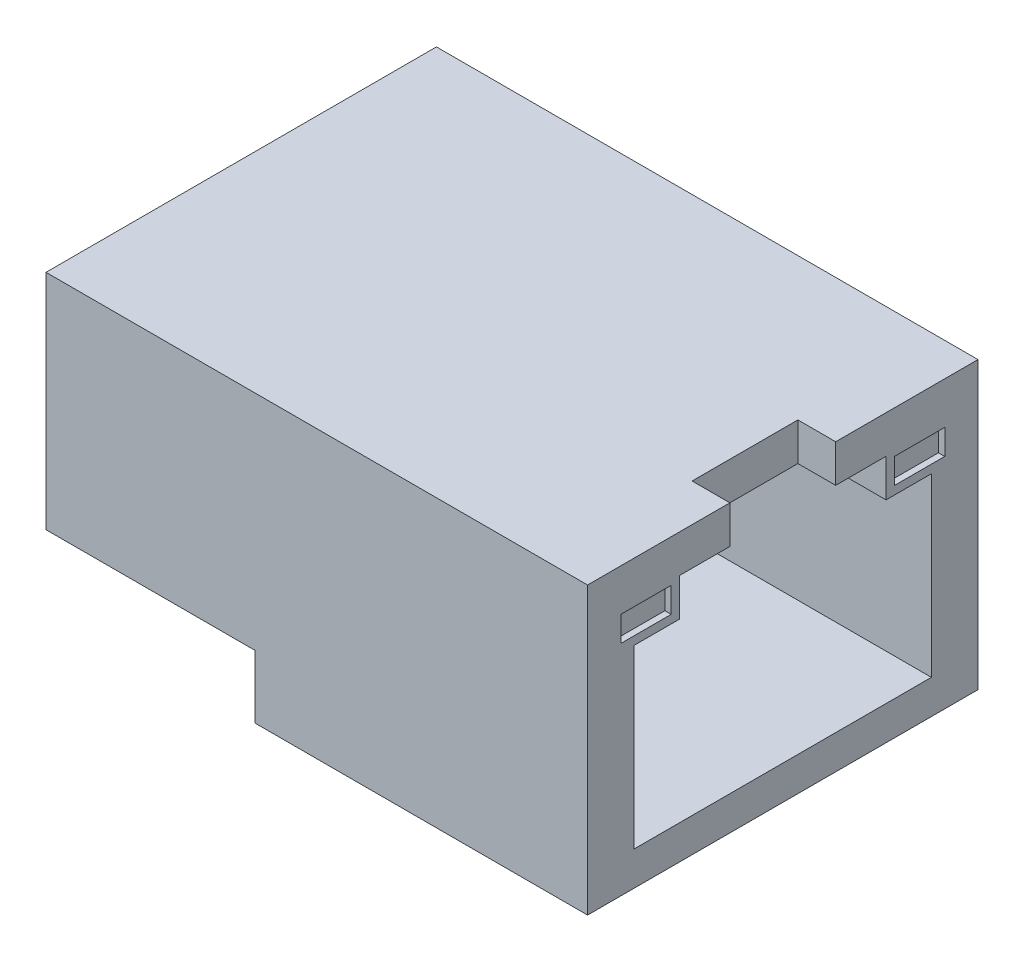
ISO-10303-21;
HEADER;
FILE_DESCRIPTION(('STEP AP214'),'2;1');
FILE_NAME('part.step','',(''),(''),'','','');
FILE_SCHEMA(('AUTOMOTIVE_DESIGN { 1 0 10303 214 1 1 1 1 }'));
ENDSEC;
DATA;
#1=APPLICATION_CONTEXT('core data for automotive mechanical design processes');
#2=APPLICATION_PROTOCOL_DEFINITION('international standard','automotive_design',2000,#1);
#3=PRODUCT_CONTEXT('',#1,'mechanical');
#4=PRODUCT('Part','Part','',(#3));
#5=PRODUCT_RELATED_PRODUCT_CATEGORY('part','',(#4));
#6=PRODUCT_DEFINITION_FORMATION('','',#4);
#7=PRODUCT_DEFINITION_CONTEXT('part definition',#1,'design');
#8=PRODUCT_DEFINITION('design','',#6,#7);
#9=PRODUCT_DEFINITION_SHAPE('','',#8);
#10=(LENGTH_UNIT() NAMED_UNIT(*) SI_UNIT(.MILLI.,.METRE.));
#11=(NAMED_UNIT(*) PLANE_ANGLE_UNIT() SI_UNIT($,.RADIAN.));
#12=(NAMED_UNIT(*) SI_UNIT($,.STERADIAN.) SOLID_ANGLE_UNIT());
#13=UNCERTAINTY_MEASURE_WITH_UNIT(LENGTH_MEASURE(1.E-05),#10,'distance_accuracy_value','');
#14=(GEOMETRIC_REPRESENTATION_CONTEXT(3) GLOBAL_UNCERTAINTY_ASSIGNED_CONTEXT((#13)) GLOBAL_UNIT_ASSIGNED_CONTEXT((#10,
#11,#12)) REPRESENTATION_CONTEXT('',''));
#15=CARTESIAN_POINT('',(0.,0.,0.));
#16=DIRECTION('',(0.,0.,1.));
#17=DIRECTION('',(1.,0.,0.));
#18=AXIS2_PLACEMENT_3D('',#15,#16,#17);
#19=CARTESIAN_POINT('',(-2.45,-4.00015005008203,15.5));
#20=DIRECTION('',(0.,1.,0.));
#21=DIRECTION('',(0.,0.,1.));
#22=AXIS2_PLACEMENT_3D('',#19,#20,#21);
#23=PLANE('',#22);
#24=CARTESIAN_POINT('',(-7.45,-4.00015005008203,11.25));
#25=DIRECTION('',(0.,1.,0.));
#26=DIRECTION('',(0.,0.,1.));
#27=AXIS2_PLACEMENT_3D('',#24,#25,#26);
#28=CIRCLE('',#27,0.55);
#29=CARTESIAN_POINT('',(-7.45,-4.00015005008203,11.8));
#30=VERTEX_POINT('',#29);
#31=EDGE_CURVE('E411',#30,#30,#28,.F.);
#32=ORIENTED_EDGE('',*,*,#31,.F.);
#33=EDGE_LOOP('',(#32));
#34=FACE_BOUND('',#33,.T.);
#35=DIRECTION('',(1.,0.,0.));
#36=VECTOR('',#35,1.);
#37=CARTESIAN_POINT('',(-2.45,-4.00015005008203,0.));
#38=LINE('',#37,#36);
#39=CARTESIAN_POINT('',(-10.75,-4.00015005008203,0.));
#40=VERTEX_POINT('',#39);
#41=CARTESIAN_POINT('',(-2.45,-4.00015005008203,0.));
#42=VERTEX_POINT('',#41);
#43=EDGE_CURVE('E383',#40,#42,#38,.T.);
#44=ORIENTED_EDGE('',*,*,#43,.T.);
#45=DIRECTION('',(0.,0.,-1.));
#46=VECTOR('',#45,1.);
#47=CARTESIAN_POINT('',(-2.45,-4.00015005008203,15.5));
#48=LINE('',#47,#46);
#49=CARTESIAN_POINT('',(-2.45,-4.00015005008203,15.5));
#50=VERTEX_POINT('',#49);
#51=EDGE_CURVE('E405',#50,#42,#48,.T.);
#52=ORIENTED_EDGE('',*,*,#51,.F.);
#53=DIRECTION('',(1.,0.,0.));
#54=VECTOR('',#53,1.);
#55=CARTESIAN_POINT('',(-2.45,-4.00015005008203,15.5));
#56=LINE('',#55,#54);
#57=CARTESIAN_POINT('',(-10.75,-4.00015005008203,15.5));
#58=VERTEX_POINT('',#57);
#59=EDGE_CURVE('E369',#58,#50,#56,.T.);
#60=ORIENTED_EDGE('',*,*,#59,.F.);
#61=DIRECTION('',(0.,0.,-1.));
#62=VECTOR('',#61,1.);
#63=CARTESIAN_POINT('',(-10.75,-4.00015005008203,15.5));
#64=LINE('',#63,#62);
#65=EDGE_CURVE('E408',#58,#40,#64,.T.);
#66=ORIENTED_EDGE('',*,*,#65,.T.);
#67=EDGE_LOOP('',(#44,#52,#60,#66));
#68=FACE_BOUND('',#67,.T.);
#69=CARTESIAN_POINT('',(-7.45,-4.00015005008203,4.25));
#70=DIRECTION('',(0.,1.,0.));
#71=DIRECTION('',(0.,0.,1.));
#72=AXIS2_PLACEMENT_3D('',#69,#70,#71);
#73=CIRCLE('',#72,0.55);
#74=CARTESIAN_POINT('',(-7.45,-4.00015005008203,4.8));
#75=VERTEX_POINT('',#74);
#76=EDGE_CURVE('E414',#75,#75,#73,.F.);
#77=ORIENTED_EDGE('',*,*,#76,.F.);
#78=EDGE_LOOP('',(#77));
#79=FACE_BOUND('',#78,.T.);
#80=ADVANCED_FACE('F37',(#34,#68,#79),#23,.F.);
#81=CARTESIAN_POINT('',(-10.75,-4.00015005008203,15.5));
#82=DIRECTION('',(1.,0.,0.));
#83=DIRECTION('',(0.,0.,-1.));
#84=AXIS2_PLACEMENT_3D('',#81,#82,#83);
#85=PLANE('',#84);
#86=DIRECTION('',(0.,-1.,0.));
#87=VECTOR('',#86,1.);
#88=CARTESIAN_POINT('',(-10.75,-4.00015005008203,0.));
#89=LINE('',#88,#87);
#90=CARTESIAN_POINT('',(-10.75,4.84984994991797,0.));
#91=VERTEX_POINT('',#90);
#92=EDGE_CURVE('E358',#91,#40,#89,.T.);
#93=ORIENTED_EDGE('',*,*,#92,.T.);
#94=ORIENTED_EDGE('',*,*,#65,.F.);
#95=DIRECTION('',(0.,-1.,0.));
#96=VECTOR('',#95,1.);
#97=CARTESIAN_POINT('',(-10.75,-4.00015005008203,15.5));
#98=LINE('',#97,#96);
#99=CARTESIAN_POINT('',(-10.75,4.84984994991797,15.5));
#100=VERTEX_POINT('',#99);
#101=EDGE_CURVE('E366',#100,#58,#98,.T.);
#102=ORIENTED_EDGE('',*,*,#101,.F.);
#103=DIRECTION('',(0.,0.,-1.));
#104=VECTOR('',#103,1.);
#105=CARTESIAN_POINT('',(-10.75,4.84984994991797,15.5));
#106=LINE('',#105,#104);
#107=EDGE_CURVE('E380',#100,#91,#106,.T.);
#108=ORIENTED_EDGE('',*,*,#107,.T.);
#109=EDGE_LOOP('',(#93,#94,#102,#108));
#110=FACE_BOUND('',#109,.T.);
#111=ADVANCED_FACE('F442',(#110),#85,.F.);
#112=CARTESIAN_POINT('',(-2.45,-6.50015005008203,15.5));
#113=DIRECTION('',(1.,0.,0.));
#114=DIRECTION('',(0.,0.,-1.));
#115=AXIS2_PLACEMENT_3D('',#112,#113,#114);
#116=PLANE('',#115);
#117=DIRECTION('',(0.,-1.,0.));
#118=VECTOR('',#117,1.);
#119=CARTESIAN_POINT('',(-2.45,-6.50015005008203,0.));
#120=LINE('',#119,#118);
#121=CARTESIAN_POINT('',(-2.45,-6.50015005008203,0.));
#122=VERTEX_POINT('',#121);
#123=EDGE_CURVE('E385',#42,#122,#120,.T.);
#124=ORIENTED_EDGE('',*,*,#123,.T.);
#125=DIRECTION('',(0.,0.,-1.));
#126=VECTOR('',#125,1.);
#127=CARTESIAN_POINT('',(-2.45,-6.50015005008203,15.5));
#128=LINE('',#127,#126);
#129=CARTESIAN_POINT('',(-2.45,-6.50015005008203,15.5));
#130=VERTEX_POINT('',#129);
#131=EDGE_CURVE('E402',#130,#122,#128,.T.);
#132=ORIENTED_EDGE('',*,*,#131,.F.);
#133=DIRECTION('',(0.,-1.,0.));
#134=VECTOR('',#133,1.);
#135=CARTESIAN_POINT('',(-2.45,-6.50015005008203,15.5));
#136=LINE('',#135,#134);
#137=EDGE_CURVE('E372',#50,#130,#136,.T.);
#138=ORIENTED_EDGE('',*,*,#137,.F.);
#139=ORIENTED_EDGE('',*,*,#51,.T.);
#140=EDGE_LOOP('',(#124,#132,#138,#139));
#141=FACE_BOUND('',#140,.T.);
#142=ADVANCED_FACE('F448',(#141),#116,.F.);
#143=CARTESIAN_POINT('',(10.75,-6.50015005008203,15.5));
#144=DIRECTION('',(0.,1.,0.));
#145=DIRECTION('',(0.,0.,1.));
#146=AXIS2_PLACEMENT_3D('',#143,#144,#145);
#147=PLANE('',#146);
#148=DIRECTION('',(1.,0.,0.));
#149=VECTOR('',#148,1.);
#150=CARTESIAN_POINT('',(10.75,-6.50015005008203,0.));
#151=LINE('',#150,#149);
#152=CARTESIAN_POINT('',(10.75,-6.50015005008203,0.));
#153=VERTEX_POINT('',#152);
#154=EDGE_CURVE('E387',#122,#153,#151,.T.);
#155=ORIENTED_EDGE('',*,*,#154,.T.);
#156=DIRECTION('',(0.,0.,-1.));
#157=VECTOR('',#156,1.);
#158=CARTESIAN_POINT('',(10.75,-6.50015005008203,15.5));
#159=LINE('',#158,#157);
#160=CARTESIAN_POINT('',(10.75,-6.50015005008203,15.5));
#161=VERTEX_POINT('',#160);
#162=EDGE_CURVE('E399',#161,#153,#159,.T.);
#163=ORIENTED_EDGE('',*,*,#162,.F.);
#164=DIRECTION('',(1.,0.,0.));
#165=VECTOR('',#164,1.);
#166=CARTESIAN_POINT('',(10.75,-6.50015005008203,15.5));
#167=LINE('',#166,#165);
#168=EDGE_CURVE('E374',#130,#161,#167,.T.);
#169=ORIENTED_EDGE('',*,*,#168,.F.);
#170=ORIENTED_EDGE('',*,*,#131,.T.);
#171=EDGE_LOOP('',(#155,#163,#169,#170));
#172=FACE_BOUND('',#171,.T.);
#173=ADVANCED_FACE('F456',(#172),#147,.F.);
#174=CARTESIAN_POINT('',(10.75,4.84984994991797,15.5));
#175=DIRECTION('',(-1.,0.,0.));
#176=DIRECTION('',(0.,-1.,0.));
#177=AXIS2_PLACEMENT_3D('',#174,#175,#176);
#178=PLANE('',#177);
#179=DIRECTION('',(0.,-1.,0.));
#180=VECTOR('',#179,1.);
#181=CARTESIAN_POINT('',(10.75,3.17984994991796,3.32));
#182=LINE('',#181,#180);
#183=CARTESIAN_POINT('',(10.75,3.17984994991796,3.32));
#184=VERTEX_POINT('',#183);
#185=CARTESIAN_POINT('',(10.75,2.17984994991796,3.32));
#186=VERTEX_POINT('',#185);
#187=EDGE_CURVE('E239',#184,#186,#182,.T.);
#188=ORIENTED_EDGE('',*,*,#187,.F.);
#189=DIRECTION('',(0.,0.,1.));
#190=VECTOR('',#189,1.);
#191=CARTESIAN_POINT('',(10.75,3.17984994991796,1.32));
#192=LINE('',#191,#190);
#193=CARTESIAN_POINT('',(10.75,3.17984994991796,1.32));
#194=VERTEX_POINT('',#193);
#195=EDGE_CURVE('E52',#194,#184,#192,.T.);
#196=ORIENTED_EDGE('',*,*,#195,.F.);
#197=DIRECTION('',(0.,1.,0.));
#198=VECTOR('',#197,1.);
#199=CARTESIAN_POINT('',(10.75,3.17984994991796,1.32));
#200=LINE('',#199,#198);
#201=CARTESIAN_POINT('',(10.75,2.17984994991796,1.32));
#202=VERTEX_POINT('',#201);
#203=EDGE_CURVE('E230',#202,#194,#200,.T.);
#204=ORIENTED_EDGE('',*,*,#203,.F.);
#205=DIRECTION('',(0.,0.,-1.));
#206=VECTOR('',#205,1.);
#207=CARTESIAN_POINT('',(10.75,2.17984994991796,1.32));
#208=LINE('',#207,#206);
#209=EDGE_CURVE('E233',#186,#202,#208,.T.);
#210=ORIENTED_EDGE('',*,*,#209,.F.);
#211=EDGE_LOOP('',(#188,#196,#204,#210));
#212=FACE_BOUND('',#211,.T.);
#213=DIRECTION('',(0.,0.,-1.));
#214=VECTOR('',#213,1.);
#215=CARTESIAN_POINT('',(10.75,2.17984994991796,14.18));
#216=LINE('',#215,#214);
#217=CARTESIAN_POINT('',(10.75,2.17984994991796,14.18));
#218=VERTEX_POINT('',#217);
#219=CARTESIAN_POINT('',(10.75,2.17984994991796,12.18));
#220=VERTEX_POINT('',#219);
#221=EDGE_CURVE('E263',#218,#220,#216,.T.);
#222=ORIENTED_EDGE('',*,*,#221,.F.);
#223=DIRECTION('',(0.,-1.,0.));
#224=VECTOR('',#223,1.);
#225=CARTESIAN_POINT('',(10.75,3.17984994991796,14.18));
#226=LINE('',#225,#224);
#227=CARTESIAN_POINT('',(10.75,3.17984994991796,14.18));
#228=VERTEX_POINT('',#227);
#229=EDGE_CURVE('E60',#228,#218,#226,.T.);
#230=ORIENTED_EDGE('',*,*,#229,.F.);
#231=DIRECTION('',(0.,0.,1.));
#232=VECTOR('',#231,1.);
#233=CARTESIAN_POINT('',(10.75,3.17984994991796,14.18));
#234=LINE('',#233,#232);
#235=CARTESIAN_POINT('',(10.75,3.17984994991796,12.18));
#236=VERTEX_POINT('',#235);
#237=EDGE_CURVE('E252',#236,#228,#234,.T.);
#238=ORIENTED_EDGE('',*,*,#237,.F.);
#239=DIRECTION('',(0.,1.,0.));
#240=VECTOR('',#239,1.);
#241=CARTESIAN_POINT('',(10.75,3.17984994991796,12.18));
#242=LINE('',#241,#240);
#243=EDGE_CURVE('E266',#220,#236,#242,.T.);
#244=ORIENTED_EDGE('',*,*,#243,.F.);
#245=EDGE_LOOP('',(#222,#230,#238,#244));
#246=FACE_BOUND('',#245,.T.);
#247=DIRECTION('',(0.,-1.,0.));
#248=VECTOR('',#247,1.);
#249=CARTESIAN_POINT('',(10.75,1.84984994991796,13.65));
#250=LINE('',#249,#248);
#251=CARTESIAN_POINT('',(10.75,1.84984994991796,13.65));
#252=VERTEX_POINT('',#251);
#253=CARTESIAN_POINT('',(10.75,-5.15015005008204,13.65));
#254=VERTEX_POINT('',#253);
#255=EDGE_CURVE('E273',#252,#254,#250,.T.);
#256=ORIENTED_EDGE('',*,*,#255,.F.);
#257=DIRECTION('',(0.,0.,1.));
#258=VECTOR('',#257,1.);
#259=CARTESIAN_POINT('',(10.75,1.84984994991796,13.65));
#260=LINE('',#259,#258);
#261=CARTESIAN_POINT('',(10.75,1.84984994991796,11.85));
#262=VERTEX_POINT('',#261);
#263=EDGE_CURVE('E301',#262,#252,#260,.T.);
#264=ORIENTED_EDGE('',*,*,#263,.F.);
#265=DIRECTION('',(0.,-1.,0.));
#266=VECTOR('',#265,1.);
#267=CARTESIAN_POINT('',(10.75,1.84984994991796,11.85));
#268=LINE('',#267,#266);
#269=CARTESIAN_POINT('',(10.75,3.34984994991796,11.85));
#270=VERTEX_POINT('',#269);
#271=EDGE_CURVE('E306',#270,#262,#268,.T.);
#272=ORIENTED_EDGE('',*,*,#271,.F.);
#273=DIRECTION('',(0.,0.,1.));
#274=VECTOR('',#273,1.);
#275=CARTESIAN_POINT('',(10.75,3.34984994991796,11.85));
#276=LINE('',#275,#274);
#277=CARTESIAN_POINT('',(10.75,3.34984994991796,9.85));
#278=VERTEX_POINT('',#277);
#279=EDGE_CURVE('E328',#278,#270,#276,.T.);
#280=ORIENTED_EDGE('',*,*,#279,.F.);
#281=DIRECTION('',(0.,-1.,0.));
#282=VECTOR('',#281,1.);
#283=CARTESIAN_POINT('',(10.75,3.34984994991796,9.85));
#284=LINE('',#283,#282);
#285=CARTESIAN_POINT('',(10.75,4.84984994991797,9.85));
#286=VERTEX_POINT('',#285);
#287=EDGE_CURVE('E333',#286,#278,#284,.T.);
#288=ORIENTED_EDGE('',*,*,#287,.F.);
#289=DIRECTION('',(0.,0.,-1.));
#290=VECTOR('',#289,1.);
#291=CARTESIAN_POINT('',(10.75,4.84984994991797,15.5));
#292=LINE('',#291,#290);
#293=CARTESIAN_POINT('',(10.75,4.84984994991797,15.5));
#294=VERTEX_POINT('',#293);
#295=EDGE_CURVE('E396',#294,#286,#292,.T.);
#296=ORIENTED_EDGE('',*,*,#295,.F.);
#297=DIRECTION('',(0.,1.,0.));
#298=VECTOR('',#297,1.);
#299=CARTESIAN_POINT('',(10.75,4.84984994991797,15.5));
#300=LINE('',#299,#298);
#301=EDGE_CURVE('E376',#161,#294,#300,.T.);
#302=ORIENTED_EDGE('',*,*,#301,.F.);
#303=ORIENTED_EDGE('',*,*,#162,.T.);
#304=DIRECTION('',(0.,1.,0.));
#305=VECTOR('',#304,1.);
#306=CARTESIAN_POINT('',(10.75,4.84984994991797,0.));
#307=LINE('',#306,#305);
#308=CARTESIAN_POINT('',(10.75,4.84984994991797,0.));
#309=VERTEX_POINT('',#308);
#310=EDGE_CURVE('E389',#153,#309,#307,.T.);
#311=ORIENTED_EDGE('',*,*,#310,.T.);
#312=CARTESIAN_POINT('',(10.75,4.84984994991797,5.65));
#313=VERTEX_POINT('',#312);
#314=EDGE_CURVE('E395',#313,#309,#292,.T.);
#315=ORIENTED_EDGE('',*,*,#314,.F.);
#316=DIRECTION('',(0.,1.,0.));
#317=VECTOR('',#316,1.);
#318=CARTESIAN_POINT('',(10.75,3.34984994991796,5.65));
#319=LINE('',#318,#317);
#320=CARTESIAN_POINT('',(10.75,3.34984994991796,5.65));
#321=VERTEX_POINT('',#320);
#322=EDGE_CURVE('E344',#321,#313,#319,.T.);
#323=ORIENTED_EDGE('',*,*,#322,.F.);
#324=CARTESIAN_POINT('',(10.75,3.34984994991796,3.65));
#325=VERTEX_POINT('',#324);
#326=EDGE_CURVE('E316',#325,#321,#276,.T.);
#327=ORIENTED_EDGE('',*,*,#326,.F.);
#328=DIRECTION('',(0.,1.,0.));
#329=VECTOR('',#328,1.);
#330=CARTESIAN_POINT('',(10.75,1.84984994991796,3.65));
#331=LINE('',#330,#329);
#332=CARTESIAN_POINT('',(10.75,1.84984994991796,3.65));
#333=VERTEX_POINT('',#332);
#334=EDGE_CURVE('E325',#333,#325,#331,.T.);
#335=ORIENTED_EDGE('',*,*,#334,.F.);
#336=CARTESIAN_POINT('',(10.75,1.84984994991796,1.85));
#337=VERTEX_POINT('',#336);
#338=EDGE_CURVE('E283',#337,#333,#260,.T.);
#339=ORIENTED_EDGE('',*,*,#338,.F.);
#340=DIRECTION('',(0.,1.,0.));
#341=VECTOR('',#340,1.);
#342=CARTESIAN_POINT('',(10.75,1.84984994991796,1.85));
#343=LINE('',#342,#341);
#344=CARTESIAN_POINT('',(10.75,-5.15015005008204,1.85));
#345=VERTEX_POINT('',#344);
#346=EDGE_CURVE('E298',#345,#337,#343,.T.);
#347=ORIENTED_EDGE('',*,*,#346,.F.);
#348=DIRECTION('',(0.,0.,-1.));
#349=VECTOR('',#348,1.);
#350=CARTESIAN_POINT('',(10.75,-5.15015005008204,13.65));
#351=LINE('',#350,#349);
#352=EDGE_CURVE('E295',#254,#345,#351,.T.);
#353=ORIENTED_EDGE('',*,*,#352,.F.);
#354=EDGE_LOOP('',(#256,#264,#272,#280,#288,#296,#302,#303,#311,#315,#323,#327,#335,#339,#347,#353));
#355=FACE_BOUND('',#354,.T.);
#356=ADVANCED_FACE('F460',(#212,#246,#355),#178,.F.);
#357=CARTESIAN_POINT('',(-10.75,4.84984994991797,15.5));
#358=DIRECTION('',(0.,-1.,0.));
#359=DIRECTION('',(0.,0.,-1.));
#360=AXIS2_PLACEMENT_3D('',#357,#358,#359);
#361=PLANE('',#360);
#362=ORIENTED_EDGE('',*,*,#295,.T.);
#363=DIRECTION('',(1.,0.,0.));
#364=VECTOR('',#363,1.);
#365=CARTESIAN_POINT('',(9.25,4.84984994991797,9.85));
#366=LINE('',#365,#364);
#367=CARTESIAN_POINT('',(9.25,4.84984994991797,9.85));
#368=VERTEX_POINT('',#367);
#369=EDGE_CURVE('E356',#368,#286,#366,.T.);
#370=ORIENTED_EDGE('',*,*,#369,.F.);
#371=DIRECTION('',(0.,0.,1.));
#372=VECTOR('',#371,1.);
#373=CARTESIAN_POINT('',(9.25,4.84984994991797,9.85));
#374=LINE('',#373,#372);
#375=CARTESIAN_POINT('',(9.25,4.84984994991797,5.65));
#376=VERTEX_POINT('',#375);
#377=EDGE_CURVE('E349',#376,#368,#374,.T.);
#378=ORIENTED_EDGE('',*,*,#377,.F.);
#379=DIRECTION('',(1.,0.,0.));
#380=VECTOR('',#379,1.);
#381=CARTESIAN_POINT('',(9.25,4.84984994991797,5.65));
#382=LINE('',#381,#380);
#383=EDGE_CURVE('E359',#376,#313,#382,.T.);
#384=ORIENTED_EDGE('',*,*,#383,.T.);
#385=ORIENTED_EDGE('',*,*,#314,.T.);
#386=DIRECTION('',(-1.,0.,0.));
#387=VECTOR('',#386,1.);
#388=CARTESIAN_POINT('',(-10.75,4.84984994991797,0.));
#389=LINE('',#388,#387);
#390=EDGE_CURVE('E370',#309,#91,#389,.T.);
#391=ORIENTED_EDGE('',*,*,#390,.T.);
#392=ORIENTED_EDGE('',*,*,#107,.F.);
#393=DIRECTION('',(-1.,0.,0.));
#394=VECTOR('',#393,1.);
#395=CARTESIAN_POINT('',(-10.75,4.84984994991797,15.5));
#396=LINE('',#395,#394);
#397=EDGE_CURVE('E378',#294,#100,#396,.T.);
#398=ORIENTED_EDGE('',*,*,#397,.F.);
#399=EDGE_LOOP('',(#362,#370,#378,#384,#385,#391,#392,#398));
#400=FACE_BOUND('',#399,.T.);
#401=ADVANCED_FACE('F464',(#400),#361,.F.);
#402=CARTESIAN_POINT('',(0.,0.,15.5));
#403=DIRECTION('',(0.,0.,-1.));
#404=DIRECTION('',(-1.,0.,0.));
#405=AXIS2_PLACEMENT_3D('',#402,#403,#404);
#406=PLANE('',#405);
#407=ORIENTED_EDGE('',*,*,#101,.T.);
#408=ORIENTED_EDGE('',*,*,#59,.T.);
#409=ORIENTED_EDGE('',*,*,#137,.T.);
#410=ORIENTED_EDGE('',*,*,#168,.T.);
#411=ORIENTED_EDGE('',*,*,#301,.T.);
#412=ORIENTED_EDGE('',*,*,#397,.T.);
#413=EDGE_LOOP('',(#407,#408,#409,#410,#411,#412));
#414=FACE_BOUND('',#413,.T.);
#415=ADVANCED_FACE('F468',(#414),#406,.F.);
#416=CARTESIAN_POINT('',(0.,0.,0.));
#417=DIRECTION('',(0.,0.,-1.));
#418=DIRECTION('',(-1.,0.,0.));
#419=AXIS2_PLACEMENT_3D('',#416,#417,#418);
#420=PLANE('',#419);
#421=ORIENTED_EDGE('',*,*,#92,.F.);
#422=ORIENTED_EDGE('',*,*,#390,.F.);
#423=ORIENTED_EDGE('',*,*,#310,.F.);
#424=ORIENTED_EDGE('',*,*,#154,.F.);
#425=ORIENTED_EDGE('',*,*,#123,.F.);
#426=ORIENTED_EDGE('',*,*,#43,.F.);
#427=EDGE_LOOP('',(#421,#422,#423,#424,#425,#426));
#428=FACE_BOUND('',#427,.T.);
#429=ADVANCED_FACE('F470',(#428),#420,.T.);
#430=CARTESIAN_POINT('',(-7.45,-5.60015005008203,11.25));
#431=DIRECTION('',(0.,1.,0.));
#432=DIRECTION('',(0.,0.,1.));
#433=AXIS2_PLACEMENT_3D('',#430,#431,#432);
#434=CYLINDRICAL_SURFACE('',#433,0.55);
#435=CARTESIAN_POINT('',(-7.45,-5.50015005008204,11.25));
#436=DIRECTION('',(0.,-1.,0.));
#437=DIRECTION('',(0.,0.,-1.));
#438=AXIS2_PLACEMENT_3D('',#435,#436,#437);
#439=CIRCLE('',#438,0.55);
#440=CARTESIAN_POINT('',(-7.45,-5.50015005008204,10.7));
#441=VERTEX_POINT('',#440);
#442=EDGE_CURVE('E11',#441,#441,#439,.F.);
#443=ORIENTED_EDGE('',*,*,#442,.T.);
#444=EDGE_LOOP('',(#443));
#445=FACE_BOUND('',#444,.T.);
#446=ORIENTED_EDGE('',*,*,#31,.T.);
#447=EDGE_LOOP('',(#446));
#448=FACE_BOUND('',#447,.T.);
#449=ADVANCED_FACE('F473',(#445,#448),#434,.T.);
#450=CARTESIAN_POINT('',(-7.45,-5.60015005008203,11.25));
#451=DIRECTION('',(0.,-1.,0.));
#452=DIRECTION('',(0.,0.,-1.));
#453=AXIS2_PLACEMENT_3D('',#450,#451,#452);
#454=PLANE('',#453);
#455=CARTESIAN_POINT('',(-7.45,-5.60015005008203,11.25));
#456=DIRECTION('',(0.,-1.,0.));
#457=DIRECTION('',(0.,0.,-1.));
#458=AXIS2_PLACEMENT_3D('',#455,#456,#457);
#459=CIRCLE('',#458,0.450000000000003);
#460=CARTESIAN_POINT('',(-7.45,-5.60015005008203,10.8));
#461=VERTEX_POINT('',#460);
#462=EDGE_CURVE('E45',#461,#461,#459,.T.);
#463=ORIENTED_EDGE('',*,*,#462,.T.);
#464=EDGE_LOOP('',(#463));
#465=FACE_BOUND('',#464,.T.);
#466=ADVANCED_FACE('F425',(#465),#454,.T.);
#467=CARTESIAN_POINT('',(-7.45,-5.60015005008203,4.25));
#468=DIRECTION('',(0.,1.,0.));
#469=DIRECTION('',(0.,0.,1.));
#470=AXIS2_PLACEMENT_3D('',#467,#468,#469);
#471=CYLINDRICAL_SURFACE('',#470,0.55);
#472=CARTESIAN_POINT('',(-7.45,-5.50015005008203,4.25));
#473=DIRECTION('',(0.,-1.,0.));
#474=DIRECTION('',(0.,0.,-1.));
#475=AXIS2_PLACEMENT_3D('',#472,#473,#474);
#476=CIRCLE('',#475,0.55);
#477=CARTESIAN_POINT('',(-7.45,-5.50015005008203,3.7));
#478=VERTEX_POINT('',#477);
#479=EDGE_CURVE('E420',#478,#478,#476,.F.);
#480=ORIENTED_EDGE('',*,*,#479,.T.);
#481=EDGE_LOOP('',(#480));
#482=FACE_BOUND('',#481,.T.);
#483=ORIENTED_EDGE('',*,*,#76,.T.);
#484=EDGE_LOOP('',(#483));
#485=FACE_BOUND('',#484,.T.);
#486=ADVANCED_FACE('F483',(#482,#485),#471,.T.);
#487=CARTESIAN_POINT('',(-7.45,-5.60015005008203,4.25));
#488=DIRECTION('',(0.,-1.,0.));
#489=DIRECTION('',(0.,0.,-1.));
#490=AXIS2_PLACEMENT_3D('',#487,#488,#489);
#491=PLANE('',#490);
#492=CARTESIAN_POINT('',(-7.45,-5.60015005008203,4.25));
#493=DIRECTION('',(0.,-1.,0.));
#494=DIRECTION('',(0.,0.,-1.));
#495=AXIS2_PLACEMENT_3D('',#492,#493,#494);
#496=CIRCLE('',#495,0.449999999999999);
#497=CARTESIAN_POINT('',(-7.45,-5.60015005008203,3.8));
#498=VERTEX_POINT('',#497);
#499=EDGE_CURVE('E417',#498,#498,#496,.T.);
#500=ORIENTED_EDGE('',*,*,#499,.T.);
#501=EDGE_LOOP('',(#500));
#502=FACE_BOUND('',#501,.T.);
#503=ADVANCED_FACE('F438',(#502),#491,.T.);
#504=CARTESIAN_POINT('',(-7.45,-5.60015005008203,4.25));
#505=DIRECTION('',(0.,1.,0.));
#506=DIRECTION('',(0.,0.,1.));
#507=AXIS2_PLACEMENT_3D('',#504,#505,#506);
#508=CONICAL_SURFACE('',#507,0.449999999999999,0.785398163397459);
#509=ORIENTED_EDGE('',*,*,#479,.F.);
#510=EDGE_LOOP('',(#509));
#511=FACE_BOUND('',#510,.T.);
#512=ORIENTED_EDGE('',*,*,#499,.F.);
#513=EDGE_LOOP('',(#512));
#514=FACE_BOUND('',#513,.T.);
#515=ADVANCED_FACE('F429',(#511,#514),#508,.T.);
#516=CARTESIAN_POINT('',(-7.45,-5.60015005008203,11.25));
#517=DIRECTION('',(0.,1.,0.));
#518=DIRECTION('',(0.,0.,1.));
#519=AXIS2_PLACEMENT_3D('',#516,#517,#518);
#520=CONICAL_SURFACE('',#519,0.450000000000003,0.785398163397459);
#521=ORIENTED_EDGE('',*,*,#442,.F.);
#522=EDGE_LOOP('',(#521));
#523=FACE_BOUND('',#522,.T.);
#524=ORIENTED_EDGE('',*,*,#462,.F.);
#525=EDGE_LOOP('',(#524));
#526=FACE_BOUND('',#525,.T.);
#527=ADVANCED_FACE('F39',(#523,#526),#520,.T.);
#528=CARTESIAN_POINT('',(9.25,3.34984994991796,9.85));
#529=DIRECTION('',(0.,0.,1.));
#530=DIRECTION('',(1.,0.,0.));
#531=AXIS2_PLACEMENT_3D('',#528,#529,#530);
#532=PLANE('',#531);
#533=ORIENTED_EDGE('',*,*,#287,.T.);
#534=DIRECTION('',(1.,0.,0.));
#535=VECTOR('',#534,1.);
#536=CARTESIAN_POINT('',(9.25,3.34984994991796,9.85));
#537=LINE('',#536,#535);
#538=CARTESIAN_POINT('',(9.25,3.34984994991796,9.85));
#539=VERTEX_POINT('',#538);
#540=EDGE_CURVE('E352',#539,#278,#537,.T.);
#541=ORIENTED_EDGE('',*,*,#540,.F.);
#542=DIRECTION('',(0.,-1.,0.));
#543=VECTOR('',#542,1.);
#544=CARTESIAN_POINT('',(9.25,3.34984994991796,9.85));
#545=LINE('',#544,#543);
#546=EDGE_CURVE('E340',#368,#539,#545,.T.);
#547=ORIENTED_EDGE('',*,*,#546,.F.);
#548=ORIENTED_EDGE('',*,*,#369,.T.);
#549=EDGE_LOOP('',(#533,#541,#547,#548));
#550=FACE_BOUND('',#549,.T.);
#551=ADVANCED_FACE('F428',(#550),#532,.F.);
#552=CARTESIAN_POINT('',(9.25,3.34984994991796,5.65));
#553=DIRECTION('',(0.,0.,-1.));
#554=DIRECTION('',(-1.,0.,0.));
#555=AXIS2_PLACEMENT_3D('',#552,#553,#554);
#556=PLANE('',#555);
#557=ORIENTED_EDGE('',*,*,#322,.T.);
#558=ORIENTED_EDGE('',*,*,#383,.F.);
#559=DIRECTION('',(0.,1.,0.));
#560=VECTOR('',#559,1.);
#561=CARTESIAN_POINT('',(9.25,3.34984994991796,5.65));
#562=LINE('',#561,#560);
#563=CARTESIAN_POINT('',(9.25,3.34984994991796,5.65));
#564=VERTEX_POINT('',#563);
#565=EDGE_CURVE('E347',#564,#376,#562,.T.);
#566=ORIENTED_EDGE('',*,*,#565,.F.);
#567=DIRECTION('',(1.,0.,0.));
#568=VECTOR('',#567,1.);
#569=CARTESIAN_POINT('',(9.25,3.34984994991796,5.65));
#570=LINE('',#569,#568);
#571=EDGE_CURVE('E362',#564,#321,#570,.T.);
#572=ORIENTED_EDGE('',*,*,#571,.T.);
#573=EDGE_LOOP('',(#557,#558,#566,#572));
#574=FACE_BOUND('',#573,.T.);
#575=ADVANCED_FACE('F435',(#574),#556,.F.);
#576=CARTESIAN_POINT('',(9.25,0.,0.));
#577=DIRECTION('',(-1.,0.,0.));
#578=DIRECTION('',(0.,0.,1.));
#579=AXIS2_PLACEMENT_3D('',#576,#577,#578);
#580=PLANE('',#579);
#581=ORIENTED_EDGE('',*,*,#546,.T.);
#582=DIRECTION('',(0.,0.,-1.));
#583=VECTOR('',#582,1.);
#584=CARTESIAN_POINT('',(9.25,3.34984994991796,9.85));
#585=LINE('',#584,#583);
#586=EDGE_CURVE('E343',#539,#564,#585,.T.);
#587=ORIENTED_EDGE('',*,*,#586,.T.);
#588=ORIENTED_EDGE('',*,*,#565,.T.);
#589=ORIENTED_EDGE('',*,*,#377,.T.);
#590=EDGE_LOOP('',(#581,#587,#588,#589));
#591=FACE_BOUND('',#590,.T.);
#592=ADVANCED_FACE('F492',(#591),#580,.F.);
#593=CARTESIAN_POINT('',(-1.25,3.34984994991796,11.85));
#594=DIRECTION('',(0.,1.,0.));
#595=DIRECTION('',(-1.,0.,0.));
#596=AXIS2_PLACEMENT_3D('',#593,#594,#595);
#597=PLANE('',#596);
#598=ORIENTED_EDGE('',*,*,#279,.T.);
#599=DIRECTION('',(1.,0.,0.));
#600=VECTOR('',#599,1.);
#601=CARTESIAN_POINT('',(-1.25,3.34984994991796,11.85));
#602=LINE('',#601,#600);
#603=CARTESIAN_POINT('',(-1.25,3.34984994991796,11.85));
#604=VERTEX_POINT('',#603);
#605=EDGE_CURVE('E330',#604,#270,#602,.T.);
#606=ORIENTED_EDGE('',*,*,#605,.F.);
#607=DIRECTION('',(0.,0.,1.));
#608=VECTOR('',#607,1.);
#609=CARTESIAN_POINT('',(-1.25,3.34984994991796,11.85));
#610=LINE('',#609,#608);
#611=CARTESIAN_POINT('',(-1.25,3.34984994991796,3.65));
#612=VERTEX_POINT('',#611);
#613=EDGE_CURVE('E319',#612,#604,#610,.T.);
#614=ORIENTED_EDGE('',*,*,#613,.F.);
#615=DIRECTION('',(1.,0.,0.));
#616=VECTOR('',#615,1.);
#617=CARTESIAN_POINT('',(-1.25,3.34984994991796,3.65));
#618=LINE('',#617,#616);
#619=EDGE_CURVE('E334',#612,#325,#618,.T.);
#620=ORIENTED_EDGE('',*,*,#619,.T.);
#621=ORIENTED_EDGE('',*,*,#326,.T.);
#622=ORIENTED_EDGE('',*,*,#571,.F.);
#623=ORIENTED_EDGE('',*,*,#586,.F.);
#624=ORIENTED_EDGE('',*,*,#540,.T.);
#625=EDGE_LOOP('',(#598,#606,#614,#620,#621,#622,#623,#624));
#626=FACE_BOUND('',#625,.T.);
#627=ADVANCED_FACE('F496',(#626),#597,.F.);
#628=CARTESIAN_POINT('',(-1.25,1.84984994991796,11.85));
#629=DIRECTION('',(0.,0.,1.));
#630=DIRECTION('',(1.,0.,0.));
#631=AXIS2_PLACEMENT_3D('',#628,#629,#630);
#632=PLANE('',#631);
#633=ORIENTED_EDGE('',*,*,#271,.T.);
#634=DIRECTION('',(1.,0.,0.));
#635=VECTOR('',#634,1.);
#636=CARTESIAN_POINT('',(-1.25,1.84984994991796,11.85));
#637=LINE('',#636,#635);
#638=CARTESIAN_POINT('',(-1.25,1.84984994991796,11.85));
#639=VERTEX_POINT('',#638);
#640=EDGE_CURVE('E322',#639,#262,#637,.T.);
#641=ORIENTED_EDGE('',*,*,#640,.F.);
#642=DIRECTION('',(0.,-1.,0.));
#643=VECTOR('',#642,1.);
#644=CARTESIAN_POINT('',(-1.25,1.84984994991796,11.85));
#645=LINE('',#644,#643);
#646=EDGE_CURVE('E312',#604,#639,#645,.T.);
#647=ORIENTED_EDGE('',*,*,#646,.F.);
#648=ORIENTED_EDGE('',*,*,#605,.T.);
#649=EDGE_LOOP('',(#633,#641,#647,#648));
#650=FACE_BOUND('',#649,.T.);
#651=ADVANCED_FACE('F498',(#650),#632,.F.);
#652=CARTESIAN_POINT('',(-1.25,1.84984994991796,3.65));
#653=DIRECTION('',(0.,0.,-1.));
#654=DIRECTION('',(-1.,0.,0.));
#655=AXIS2_PLACEMENT_3D('',#652,#653,#654);
#656=PLANE('',#655);
#657=ORIENTED_EDGE('',*,*,#334,.T.);
#658=ORIENTED_EDGE('',*,*,#619,.F.);
#659=DIRECTION('',(0.,1.,0.));
#660=VECTOR('',#659,1.);
#661=CARTESIAN_POINT('',(-1.25,1.84984994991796,3.65));
#662=LINE('',#661,#660);
#663=CARTESIAN_POINT('',(-1.25,1.84984994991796,3.65));
#664=VERTEX_POINT('',#663);
#665=EDGE_CURVE('E315',#664,#612,#662,.T.);
#666=ORIENTED_EDGE('',*,*,#665,.F.);
#667=DIRECTION('',(1.,0.,0.));
#668=VECTOR('',#667,1.);
#669=CARTESIAN_POINT('',(-1.25,1.84984994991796,3.65));
#670=LINE('',#669,#668);
#671=EDGE_CURVE('E336',#664,#333,#670,.T.);
#672=ORIENTED_EDGE('',*,*,#671,.T.);
#673=EDGE_LOOP('',(#657,#658,#666,#672));
#674=FACE_BOUND('',#673,.T.);
#675=ADVANCED_FACE('F501',(#674),#656,.F.);
#676=CARTESIAN_POINT('',(-1.25,0.,0.));
#677=DIRECTION('',(-1.,0.,0.));
#678=DIRECTION('',(0.,0.,1.));
#679=AXIS2_PLACEMENT_3D('',#676,#677,#678);
#680=PLANE('',#679);
#681=ORIENTED_EDGE('',*,*,#646,.T.);
#682=DIRECTION('',(0.,0.,1.));
#683=VECTOR('',#682,1.);
#684=CARTESIAN_POINT('',(-1.25,1.84984994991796,13.65));
#685=LINE('',#684,#683);
#686=CARTESIAN_POINT('',(-1.25,1.84984994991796,13.65));
#687=VERTEX_POINT('',#686);
#688=EDGE_CURVE('E289',#639,#687,#685,.T.);
#689=ORIENTED_EDGE('',*,*,#688,.T.);
#690=DIRECTION('',(0.,-1.,0.));
#691=VECTOR('',#690,1.);
#692=CARTESIAN_POINT('',(-1.25,1.84984994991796,13.65));
#693=LINE('',#692,#691);
#694=CARTESIAN_POINT('',(-1.25,-5.15015005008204,13.65));
#695=VERTEX_POINT('',#694);
#696=EDGE_CURVE('E279',#687,#695,#693,.T.);
#697=ORIENTED_EDGE('',*,*,#696,.T.);
#698=DIRECTION('',(0.,0.,-1.));
#699=VECTOR('',#698,1.);
#700=CARTESIAN_POINT('',(-1.25,-5.15015005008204,13.65));
#701=LINE('',#700,#699);
#702=CARTESIAN_POINT('',(-1.25,-5.15015005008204,1.85));
#703=VERTEX_POINT('',#702);
#704=EDGE_CURVE('E282',#695,#703,#701,.T.);
#705=ORIENTED_EDGE('',*,*,#704,.T.);
#706=DIRECTION('',(0.,1.,0.));
#707=VECTOR('',#706,1.);
#708=CARTESIAN_POINT('',(-1.25,1.84984994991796,1.85));
#709=LINE('',#708,#707);
#710=CARTESIAN_POINT('',(-1.25,1.84984994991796,1.85));
#711=VERTEX_POINT('',#710);
#712=EDGE_CURVE('E286',#703,#711,#709,.T.);
#713=ORIENTED_EDGE('',*,*,#712,.T.);
#714=EDGE_CURVE('E290',#711,#664,#685,.T.);
#715=ORIENTED_EDGE('',*,*,#714,.T.);
#716=ORIENTED_EDGE('',*,*,#665,.T.);
#717=ORIENTED_EDGE('',*,*,#613,.T.);
#718=EDGE_LOOP('',(#681,#689,#697,#705,#713,#715,#716,#717));
#719=FACE_BOUND('',#718,.T.);
#720=ADVANCED_FACE('F505',(#719),#680,.F.);
#721=CARTESIAN_POINT('',(-1.25,1.84984994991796,13.65));
#722=DIRECTION('',(0.,1.,0.));
#723=DIRECTION('',(-1.,0.,0.));
#724=AXIS2_PLACEMENT_3D('',#721,#722,#723);
#725=PLANE('',#724);
#726=ORIENTED_EDGE('',*,*,#263,.T.);
#727=DIRECTION('',(1.,0.,0.));
#728=VECTOR('',#727,1.);
#729=CARTESIAN_POINT('',(-1.25,1.84984994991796,13.65));
#730=LINE('',#729,#728);
#731=EDGE_CURVE('E303',#687,#252,#730,.T.);
#732=ORIENTED_EDGE('',*,*,#731,.F.);
#733=ORIENTED_EDGE('',*,*,#688,.F.);
#734=ORIENTED_EDGE('',*,*,#640,.T.);
#735=EDGE_LOOP('',(#726,#732,#733,#734));
#736=FACE_BOUND('',#735,.T.);
#737=ADVANCED_FACE('F512',(#736),#725,.F.);
#738=ORIENTED_EDGE('',*,*,#714,.F.);
#739=DIRECTION('',(1.,0.,0.));
#740=VECTOR('',#739,1.);
#741=CARTESIAN_POINT('',(-1.25,1.84984994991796,1.85));
#742=LINE('',#741,#740);
#743=EDGE_CURVE('E307',#711,#337,#742,.T.);
#744=ORIENTED_EDGE('',*,*,#743,.T.);
#745=ORIENTED_EDGE('',*,*,#338,.T.);
#746=ORIENTED_EDGE('',*,*,#671,.F.);
#747=EDGE_LOOP('',(#738,#744,#745,#746));
#748=FACE_BOUND('',#747,.T.);
#749=ADVANCED_FACE('F518',(#748),#725,.F.);
#750=CARTESIAN_POINT('',(-1.25,1.84984994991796,13.65));
#751=DIRECTION('',(0.,0.,1.));
#752=DIRECTION('',(0.,-1.,0.));
#753=AXIS2_PLACEMENT_3D('',#750,#751,#752);
#754=PLANE('',#753);
#755=ORIENTED_EDGE('',*,*,#255,.T.);
#756=DIRECTION('',(1.,0.,0.));
#757=VECTOR('',#756,1.);
#758=CARTESIAN_POINT('',(-1.25,-5.15015005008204,13.65));
#759=LINE('',#758,#757);
#760=EDGE_CURVE('E292',#695,#254,#759,.T.);
#761=ORIENTED_EDGE('',*,*,#760,.F.);
#762=ORIENTED_EDGE('',*,*,#696,.F.);
#763=ORIENTED_EDGE('',*,*,#731,.T.);
#764=EDGE_LOOP('',(#755,#761,#762,#763));
#765=FACE_BOUND('',#764,.T.);
#766=ADVANCED_FACE('F514',(#765),#754,.F.);
#767=CARTESIAN_POINT('',(-1.25,1.84984994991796,1.85));
#768=DIRECTION('',(0.,0.,-1.));
#769=DIRECTION('',(0.,1.,0.));
#770=AXIS2_PLACEMENT_3D('',#767,#768,#769);
#771=PLANE('',#770);
#772=ORIENTED_EDGE('',*,*,#346,.T.);
#773=ORIENTED_EDGE('',*,*,#743,.F.);
#774=ORIENTED_EDGE('',*,*,#712,.F.);
#775=DIRECTION('',(1.,0.,0.));
#776=VECTOR('',#775,1.);
#777=CARTESIAN_POINT('',(-1.25,-5.15015005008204,1.85));
#778=LINE('',#777,#776);
#779=EDGE_CURVE('E309',#703,#345,#778,.T.);
#780=ORIENTED_EDGE('',*,*,#779,.T.);
#781=EDGE_LOOP('',(#772,#773,#774,#780));
#782=FACE_BOUND('',#781,.T.);
#783=ADVANCED_FACE('F517',(#782),#771,.F.);
#784=CARTESIAN_POINT('',(-1.25,-5.15015005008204,13.65));
#785=DIRECTION('',(0.,-1.,0.));
#786=DIRECTION('',(1.,0.,0.));
#787=AXIS2_PLACEMENT_3D('',#784,#785,#786);
#788=PLANE('',#787);
#789=ORIENTED_EDGE('',*,*,#352,.T.);
#790=ORIENTED_EDGE('',*,*,#779,.F.);
#791=ORIENTED_EDGE('',*,*,#704,.F.);
#792=ORIENTED_EDGE('',*,*,#760,.T.);
#793=EDGE_LOOP('',(#789,#790,#791,#792));
#794=FACE_BOUND('',#793,.T.);
#795=ADVANCED_FACE('F520',(#794),#788,.F.);
#796=CARTESIAN_POINT('',(10.5,3.17984994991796,14.18));
#797=DIRECTION('',(0.,0.,1.));
#798=DIRECTION('',(1.,0.,0.));
#799=AXIS2_PLACEMENT_3D('',#796,#797,#798);
#800=PLANE('',#799);
#801=ORIENTED_EDGE('',*,*,#229,.T.);
#802=DIRECTION('',(1.,0.,0.));
#803=VECTOR('',#802,1.);
#804=CARTESIAN_POINT('',(10.5,2.17984994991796,14.18));
#805=LINE('',#804,#803);
#806=CARTESIAN_POINT('',(10.5,2.17984994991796,14.18));
#807=VERTEX_POINT('',#806);
#808=EDGE_CURVE('E261',#807,#218,#805,.T.);
#809=ORIENTED_EDGE('',*,*,#808,.F.);
#810=DIRECTION('',(0.,-1.,0.));
#811=VECTOR('',#810,1.);
#812=CARTESIAN_POINT('',(10.5,3.17984994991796,14.18));
#813=LINE('',#812,#811);
#814=CARTESIAN_POINT('',(10.5,3.17984994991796,14.18));
#815=VERTEX_POINT('',#814);
#816=EDGE_CURVE('E248',#815,#807,#813,.T.);
#817=ORIENTED_EDGE('',*,*,#816,.F.);
#818=DIRECTION('',(1.,0.,0.));
#819=VECTOR('',#818,1.);
#820=CARTESIAN_POINT('',(10.5,3.17984994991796,14.18));
#821=LINE('',#820,#819);
#822=EDGE_CURVE('E271',#815,#228,#821,.T.);
#823=ORIENTED_EDGE('',*,*,#822,.T.);
#824=EDGE_LOOP('',(#801,#809,#817,#823));
#825=FACE_BOUND('',#824,.T.);
#826=ADVANCED_FACE('F523',(#825),#800,.F.);
#827=CARTESIAN_POINT('',(10.5,3.17984994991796,14.18));
#828=DIRECTION('',(0.,1.,0.));
#829=DIRECTION('',(0.,0.,1.));
#830=AXIS2_PLACEMENT_3D('',#827,#828,#829);
#831=PLANE('',#830);
#832=ORIENTED_EDGE('',*,*,#237,.T.);
#833=ORIENTED_EDGE('',*,*,#822,.F.);
#834=DIRECTION('',(0.,0.,1.));
#835=VECTOR('',#834,1.);
#836=CARTESIAN_POINT('',(10.5,3.17984994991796,14.18));
#837=LINE('',#836,#835);
#838=CARTESIAN_POINT('',(10.5,3.17984994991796,12.18));
#839=VERTEX_POINT('',#838);
#840=EDGE_CURVE('E258',#839,#815,#837,.T.);
#841=ORIENTED_EDGE('',*,*,#840,.F.);
#842=DIRECTION('',(1.,0.,0.));
#843=VECTOR('',#842,1.);
#844=CARTESIAN_POINT('',(10.5,3.17984994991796,12.18));
#845=LINE('',#844,#843);
#846=EDGE_CURVE('E274',#839,#236,#845,.T.);
#847=ORIENTED_EDGE('',*,*,#846,.T.);
#848=EDGE_LOOP('',(#832,#833,#841,#847));
#849=FACE_BOUND('',#848,.T.);
#850=ADVANCED_FACE('F533',(#849),#831,.F.);
#851=CARTESIAN_POINT('',(10.5,3.17984994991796,12.18));
#852=DIRECTION('',(0.,0.,-1.));
#853=DIRECTION('',(-1.,0.,0.));
#854=AXIS2_PLACEMENT_3D('',#851,#852,#853);
#855=PLANE('',#854);
#856=ORIENTED_EDGE('',*,*,#243,.T.);
#857=ORIENTED_EDGE('',*,*,#846,.F.);
#858=DIRECTION('',(0.,1.,0.));
#859=VECTOR('',#858,1.);
#860=CARTESIAN_POINT('',(10.5,3.17984994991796,12.18));
#861=LINE('',#860,#859);
#862=CARTESIAN_POINT('',(10.5,2.17984994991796,12.18));
#863=VERTEX_POINT('',#862);
#864=EDGE_CURVE('E255',#863,#839,#861,.T.);
#865=ORIENTED_EDGE('',*,*,#864,.F.);
#866=DIRECTION('',(1.,0.,0.));
#867=VECTOR('',#866,1.);
#868=CARTESIAN_POINT('',(10.5,2.17984994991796,12.18));
#869=LINE('',#868,#867);
#870=EDGE_CURVE('E276',#863,#220,#869,.T.);
#871=ORIENTED_EDGE('',*,*,#870,.T.);
#872=EDGE_LOOP('',(#856,#857,#865,#871));
#873=FACE_BOUND('',#872,.T.);
#874=ADVANCED_FACE('F538',(#873),#855,.F.);
#875=CARTESIAN_POINT('',(10.5,2.17984994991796,14.18));
#876=DIRECTION('',(0.,-1.,0.));
#877=DIRECTION('',(1.,0.,0.));
#878=AXIS2_PLACEMENT_3D('',#875,#876,#877);
#879=PLANE('',#878);
#880=ORIENTED_EDGE('',*,*,#221,.T.);
#881=ORIENTED_EDGE('',*,*,#870,.F.);
#882=DIRECTION('',(0.,0.,-1.));
#883=VECTOR('',#882,1.);
#884=CARTESIAN_POINT('',(10.5,2.17984994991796,14.18));
#885=LINE('',#884,#883);
#886=EDGE_CURVE('E251',#807,#863,#885,.T.);
#887=ORIENTED_EDGE('',*,*,#886,.F.);
#888=ORIENTED_EDGE('',*,*,#808,.T.);
#889=EDGE_LOOP('',(#880,#881,#887,#888));
#890=FACE_BOUND('',#889,.T.);
#891=ADVANCED_FACE('F534',(#890),#879,.F.);
#892=CARTESIAN_POINT('',(10.5,0.,0.));
#893=DIRECTION('',(1.,0.,0.));
#894=DIRECTION('',(0.,0.,-1.));
#895=AXIS2_PLACEMENT_3D('',#892,#893,#894);
#896=PLANE('',#895);
#897=ORIENTED_EDGE('',*,*,#816,.T.);
#898=ORIENTED_EDGE('',*,*,#886,.T.);
#899=ORIENTED_EDGE('',*,*,#864,.T.);
#900=ORIENTED_EDGE('',*,*,#840,.T.);
#901=EDGE_LOOP('',(#897,#898,#899,#900));
#902=FACE_BOUND('',#901,.T.);
#903=ADVANCED_FACE('F537',(#902),#896,.T.);
#904=CARTESIAN_POINT('',(10.5,3.17984994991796,1.32));
#905=DIRECTION('',(0.,1.,0.));
#906=DIRECTION('',(0.,0.,1.));
#907=AXIS2_PLACEMENT_3D('',#904,#905,#906);
#908=PLANE('',#907);
#909=ORIENTED_EDGE('',*,*,#195,.T.);
#910=DIRECTION('',(1.,0.,0.));
#911=VECTOR('',#910,1.);
#912=CARTESIAN_POINT('',(10.5,3.17984994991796,3.32));
#913=LINE('',#912,#911);
#914=CARTESIAN_POINT('',(10.5,3.17984994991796,3.32));
#915=VERTEX_POINT('',#914);
#916=EDGE_CURVE('E208',#915,#184,#913,.T.);
#917=ORIENTED_EDGE('',*,*,#916,.F.);
#918=DIRECTION('',(0.,0.,1.));
#919=VECTOR('',#918,1.);
#920=CARTESIAN_POINT('',(10.5,3.17984994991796,1.32));
#921=LINE('',#920,#919);
#922=CARTESIAN_POINT('',(10.5,3.17984994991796,1.32));
#923=VERTEX_POINT('',#922);
#924=EDGE_CURVE('E212',#923,#915,#921,.T.);
#925=ORIENTED_EDGE('',*,*,#924,.F.);
#926=DIRECTION('',(1.,0.,0.));
#927=VECTOR('',#926,1.);
#928=CARTESIAN_POINT('',(10.5,3.17984994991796,1.32));
#929=LINE('',#928,#927);
#930=EDGE_CURVE('E243',#923,#194,#929,.T.);
#931=ORIENTED_EDGE('',*,*,#930,.T.);
#932=EDGE_LOOP('',(#909,#917,#925,#931));
#933=FACE_BOUND('',#932,.T.);
#934=ADVANCED_FACE('F210',(#933),#908,.F.);
#935=CARTESIAN_POINT('',(10.5,3.17984994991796,1.32));
#936=DIRECTION('',(0.,0.,-1.));
#937=DIRECTION('',(-1.,0.,0.));
#938=AXIS2_PLACEMENT_3D('',#935,#936,#937);
#939=PLANE('',#938);
#940=ORIENTED_EDGE('',*,*,#203,.T.);
#941=ORIENTED_EDGE('',*,*,#930,.F.);
#942=DIRECTION('',(0.,1.,0.));
#943=VECTOR('',#942,1.);
#944=CARTESIAN_POINT('',(10.5,3.17984994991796,1.32));
#945=LINE('',#944,#943);
#946=CARTESIAN_POINT('',(10.5,2.17984994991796,1.32));
#947=VERTEX_POINT('',#946);
#948=EDGE_CURVE('E218',#947,#923,#945,.T.);
#949=ORIENTED_EDGE('',*,*,#948,.F.);
#950=DIRECTION('',(1.,0.,0.));
#951=VECTOR('',#950,1.);
#952=CARTESIAN_POINT('',(10.5,2.17984994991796,1.32));
#953=LINE('',#952,#951);
#954=EDGE_CURVE('E245',#947,#202,#953,.T.);
#955=ORIENTED_EDGE('',*,*,#954,.T.);
#956=EDGE_LOOP('',(#940,#941,#949,#955));
#957=FACE_BOUND('',#956,.T.);
#958=ADVANCED_FACE('F551',(#957),#939,.F.);
#959=CARTESIAN_POINT('',(10.5,2.17984994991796,1.32));
#960=DIRECTION('',(0.,-1.,0.));
#961=DIRECTION('',(1.,0.,0.));
#962=AXIS2_PLACEMENT_3D('',#959,#960,#961);
#963=PLANE('',#962);
#964=ORIENTED_EDGE('',*,*,#209,.T.);
#965=ORIENTED_EDGE('',*,*,#954,.F.);
#966=DIRECTION('',(0.,0.,-1.));
#967=VECTOR('',#966,1.);
#968=CARTESIAN_POINT('',(10.5,2.17984994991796,1.32));
#969=LINE('',#968,#967);
#970=CARTESIAN_POINT('',(10.5,2.17984994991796,3.32));
#971=VERTEX_POINT('',#970);
#972=EDGE_CURVE('E226',#971,#947,#969,.T.);
#973=ORIENTED_EDGE('',*,*,#972,.F.);
#974=DIRECTION('',(1.,0.,0.));
#975=VECTOR('',#974,1.);
#976=CARTESIAN_POINT('',(10.5,2.17984994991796,3.32));
#977=LINE('',#976,#975);
#978=EDGE_CURVE('E217',#971,#186,#977,.T.);
#979=ORIENTED_EDGE('',*,*,#978,.T.);
#980=EDGE_LOOP('',(#964,#965,#973,#979));
#981=FACE_BOUND('',#980,.T.);
#982=ADVANCED_FACE('F554',(#981),#963,.F.);
#983=CARTESIAN_POINT('',(10.5,3.17984994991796,3.32));
#984=DIRECTION('',(0.,0.,1.));
#985=DIRECTION('',(1.,0.,0.));
#986=AXIS2_PLACEMENT_3D('',#983,#984,#985);
#987=PLANE('',#986);
#988=ORIENTED_EDGE('',*,*,#187,.T.);
#989=ORIENTED_EDGE('',*,*,#978,.F.);
#990=DIRECTION('',(0.,-1.,0.));
#991=VECTOR('',#990,1.);
#992=CARTESIAN_POINT('',(10.5,3.17984994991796,3.32));
#993=LINE('',#992,#991);
#994=EDGE_CURVE('E221',#915,#971,#993,.T.);
#995=ORIENTED_EDGE('',*,*,#994,.F.);
#996=ORIENTED_EDGE('',*,*,#916,.T.);
#997=EDGE_LOOP('',(#988,#989,#995,#996));
#998=FACE_BOUND('',#997,.T.);
#999=ADVANCED_FACE('F222',(#998),#987,.F.);
#1000=CARTESIAN_POINT('',(10.5,0.,0.));
#1001=DIRECTION('',(1.,0.,0.));
#1002=DIRECTION('',(0.,0.,-1.));
#1003=AXIS2_PLACEMENT_3D('',#1000,#1001,#1002);
#1004=PLANE('',#1003);
#1005=ORIENTED_EDGE('',*,*,#924,.T.);
#1006=ORIENTED_EDGE('',*,*,#994,.T.);
#1007=ORIENTED_EDGE('',*,*,#972,.T.);
#1008=ORIENTED_EDGE('',*,*,#948,.T.);
#1009=EDGE_LOOP('',(#1005,#1006,#1007,#1008));
#1010=FACE_BOUND('',#1009,.T.);
#1011=ADVANCED_FACE('F228',(#1010),#1004,.T.);
#1012=CLOSED_SHELL('',(#80,#111,#142,#173,#356,#401,#415,#429,#449,#466,#486,#503,#515,#527,
#551,#575,#592,#627,#651,#675,#720,#737,#749,#766,#783,#795,#826,#850,#874,#891,#903,#934,#958,
#982,#999,#1011));
#1013=MANIFOLD_SOLID_BREP('B2',#1012);
#1014=ADVANCED_BREP_SHAPE_REPRESENTATION('',(#18,#1013),#14);
#1015=SHAPE_DEFINITION_REPRESENTATION(#9,#1014);
ENDSEC;
END-ISO-10303-21;
